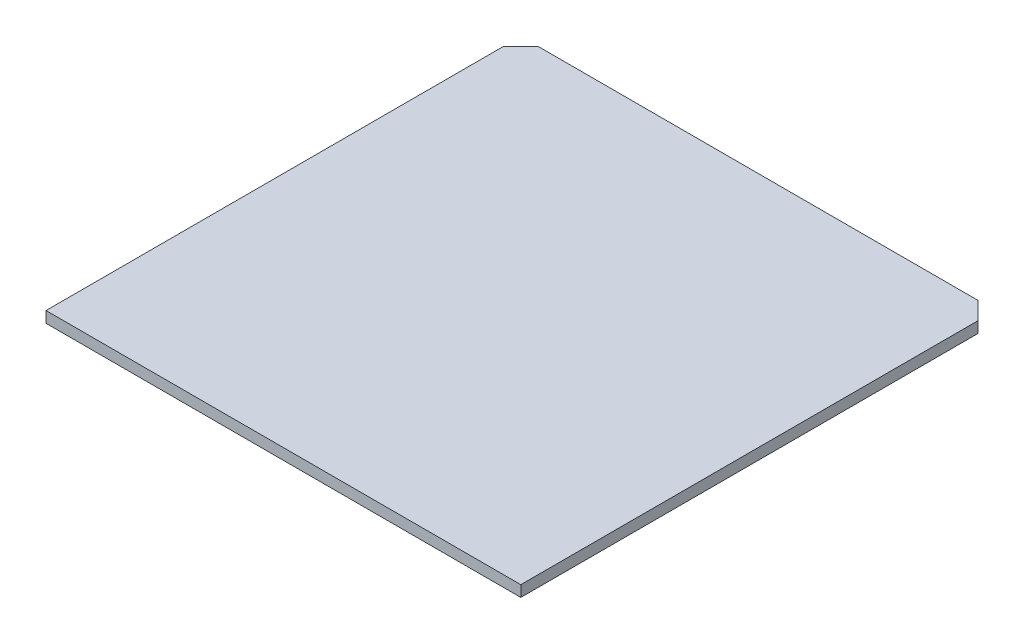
from build123d import *

# Parameters (mm, degrees)
SKETCH1_W           = 68.58
SKETCH1_H           = 68.58
BOSS_EXTRUDE1_DEPTH = 1.6
CHAMFER1_SIZE       = 2.54


with BuildPart() as part:
    # Sketch1 → Boss-Extrude1 (new body)
    with BuildSketch(Plane(origin=(0, 0, 0), x_dir=(1, 0, 0), z_dir=(0, 1, 0))):
        Rectangle(SKETCH1_W, SKETCH1_H)
    extrude(amount=BOSS_EXTRUDE1_DEPTH)

    # Chamfer1
    chamfer1_edges = [part.edges().sort_by_distance(p)[0] for p in [
        (-34.29, 0.8, -34.29),
        (34.29, 0.8, -34.29),
    ]]
    chamfer(chamfer1_edges, length=CHAMFER1_SIZE)


solid = part.part
